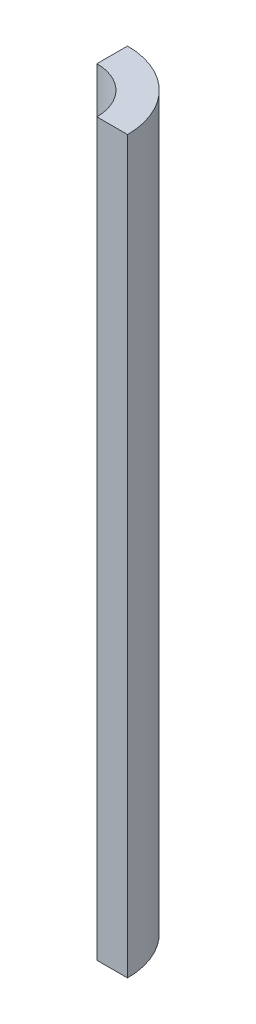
from build123d import *

# Parameters (mm, degrees)
BOSS_EXTRUDE1_DEPTH = 47.625


with BuildPart() as part:
    # Sketch1 → Boss-Extrude1 (new body)
    with BuildSketch(Plane(origin=(0, 0, 0), x_dir=(1, 0, 0), z_dir=(0, 1, 0))):
        with BuildLine():
            Line((0, 3), (0, 5))
            ThreePointArc((0, 5), (3.535533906, 3.535533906), (5, 0))
            Line((5, 0), (3, 0))
            ThreePointArc((3, 0), (2.121320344, 2.121320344), (0, 3))
        make_face()
    extrude(amount=BOSS_EXTRUDE1_DEPTH)


solid = part.part
